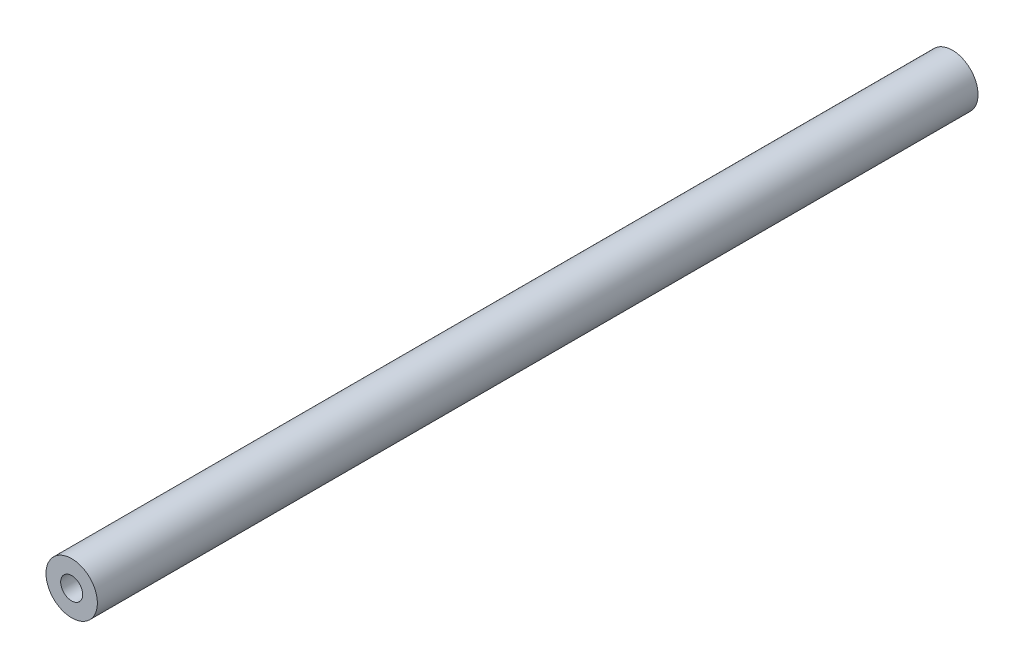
ISO-10303-21;
HEADER;
FILE_DESCRIPTION(('STEP AP214'),'2;1');
FILE_NAME('part.step','',(''),(''),'','','');
FILE_SCHEMA(('AUTOMOTIVE_DESIGN { 1 0 10303 214 1 1 1 1 }'));
ENDSEC;
DATA;
#1=APPLICATION_CONTEXT('core data for automotive mechanical design processes');
#2=APPLICATION_PROTOCOL_DEFINITION('international standard','automotive_design',2000,#1);
#3=PRODUCT_CONTEXT('',#1,'mechanical');
#4=PRODUCT('Part','Part','',(#3));
#5=PRODUCT_RELATED_PRODUCT_CATEGORY('part','',(#4));
#6=PRODUCT_DEFINITION_FORMATION('','',#4);
#7=PRODUCT_DEFINITION_CONTEXT('part definition',#1,'design');
#8=PRODUCT_DEFINITION('design','',#6,#7);
#9=PRODUCT_DEFINITION_SHAPE('','',#8);
#10=(LENGTH_UNIT() NAMED_UNIT(*) SI_UNIT(.MILLI.,.METRE.));
#11=(NAMED_UNIT(*) PLANE_ANGLE_UNIT() SI_UNIT($,.RADIAN.));
#12=(NAMED_UNIT(*) SI_UNIT($,.STERADIAN.) SOLID_ANGLE_UNIT());
#13=UNCERTAINTY_MEASURE_WITH_UNIT(LENGTH_MEASURE(1.E-05),#10,'distance_accuracy_value','');
#14=(GEOMETRIC_REPRESENTATION_CONTEXT(3) GLOBAL_UNCERTAINTY_ASSIGNED_CONTEXT((#13)) GLOBAL_UNIT_ASSIGNED_CONTEXT((#10,
#11,#12)) REPRESENTATION_CONTEXT('',''));
#15=CARTESIAN_POINT('',(0.,0.,0.));
#16=DIRECTION('',(0.,0.,1.));
#17=DIRECTION('',(1.,0.,0.));
#18=AXIS2_PLACEMENT_3D('',#15,#16,#17);
#19=CARTESIAN_POINT('',(0.,1.5,120.));
#20=DIRECTION('',(0.,0.,1.));
#21=DIRECTION('',(1.,0.,0.));
#22=AXIS2_PLACEMENT_3D('',#19,#20,#21);
#23=PLANE('',#22);
#24=CARTESIAN_POINT('',(0.,0.,120.));
#25=DIRECTION('',(0.,0.,-1.));
#26=DIRECTION('',(-1.,0.,0.));
#27=AXIS2_PLACEMENT_3D('',#24,#25,#26);
#28=CIRCLE('',#27,1.5);
#29=CARTESIAN_POINT('',(-1.5,0.,120.));
#30=VERTEX_POINT('',#29);
#31=EDGE_CURVE('E49',#30,#30,#28,.T.);
#32=ORIENTED_EDGE('',*,*,#31,.T.);
#33=EDGE_LOOP('',(#32));
#34=FACE_BOUND('',#33,.T.);
#35=CARTESIAN_POINT('',(0.,0.,120.));
#36=DIRECTION('',(0.,0.,-1.));
#37=DIRECTION('',(-1.,0.,0.));
#38=AXIS2_PLACEMENT_3D('',#35,#36,#37);
#39=CIRCLE('',#38,3.5);
#40=CARTESIAN_POINT('',(-3.5,0.,120.));
#41=VERTEX_POINT('',#40);
#42=EDGE_CURVE('E10',#41,#41,#39,.T.);
#43=ORIENTED_EDGE('',*,*,#42,.F.);
#44=EDGE_LOOP('',(#43));
#45=FACE_BOUND('',#44,.T.);
#46=ADVANCED_FACE('F33',(#34,#45),#23,.T.);
#47=CARTESIAN_POINT('',(0.,0.,-5.30307027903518));
#48=DIRECTION('',(0.,0.,-1.));
#49=DIRECTION('',(-1.,0.,0.));
#50=AXIS2_PLACEMENT_3D('',#47,#48,#49);
#51=CYLINDRICAL_SURFACE('',#50,3.5);
#52=ORIENTED_EDGE('',*,*,#42,.T.);
#53=EDGE_LOOP('',(#52));
#54=FACE_BOUND('',#53,.T.);
#55=CARTESIAN_POINT('',(0.,0.,0.));
#56=DIRECTION('',(0.,0.,-1.));
#57=DIRECTION('',(-1.,0.,0.));
#58=AXIS2_PLACEMENT_3D('',#55,#56,#57);
#59=CIRCLE('',#58,3.5);
#60=CARTESIAN_POINT('',(-3.5,0.,0.));
#61=VERTEX_POINT('',#60);
#62=EDGE_CURVE('E39',#61,#61,#59,.T.);
#63=ORIENTED_EDGE('',*,*,#62,.F.);
#64=EDGE_LOOP('',(#63));
#65=FACE_BOUND('',#64,.T.);
#66=ADVANCED_FACE('F65',(#54,#65),#51,.T.);
#67=CARTESIAN_POINT('',(0.,1.5,0.));
#68=DIRECTION('',(0.,0.,-1.));
#69=DIRECTION('',(-1.,0.,0.));
#70=AXIS2_PLACEMENT_3D('',#67,#68,#69);
#71=PLANE('',#70);
#72=ORIENTED_EDGE('',*,*,#62,.T.);
#73=EDGE_LOOP('',(#72));
#74=FACE_BOUND('',#73,.T.);
#75=CARTESIAN_POINT('',(0.,0.,0.));
#76=DIRECTION('',(0.,0.,-1.));
#77=DIRECTION('',(-1.,0.,0.));
#78=AXIS2_PLACEMENT_3D('',#75,#76,#77);
#79=CIRCLE('',#78,1.5);
#80=CARTESIAN_POINT('',(-1.5,0.,0.));
#81=VERTEX_POINT('',#80);
#82=EDGE_CURVE('E44',#81,#81,#79,.T.);
#83=ORIENTED_EDGE('',*,*,#82,.F.);
#84=EDGE_LOOP('',(#83));
#85=FACE_BOUND('',#84,.T.);
#86=ADVANCED_FACE('F59',(#74,#85),#71,.T.);
#87=CARTESIAN_POINT('',(0.,0.,-5.30307027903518));
#88=DIRECTION('',(0.,0.,-1.));
#89=DIRECTION('',(-1.,0.,0.));
#90=AXIS2_PLACEMENT_3D('',#87,#88,#89);
#91=CYLINDRICAL_SURFACE('',#90,1.5);
#92=ORIENTED_EDGE('',*,*,#82,.T.);
#93=EDGE_LOOP('',(#92));
#94=FACE_BOUND('',#93,.T.);
#95=ORIENTED_EDGE('',*,*,#31,.F.);
#96=EDGE_LOOP('',(#95));
#97=FACE_BOUND('',#96,.T.);
#98=ADVANCED_FACE('F57',(#94,#97),#91,.F.);
#99=CLOSED_SHELL('',(#46,#66,#86,#98));
#100=MANIFOLD_SOLID_BREP('B2',#99);
#101=ADVANCED_BREP_SHAPE_REPRESENTATION('',(#18,#100),#14);
#102=SHAPE_DEFINITION_REPRESENTATION(#9,#101);
ENDSEC;
END-ISO-10303-21;
